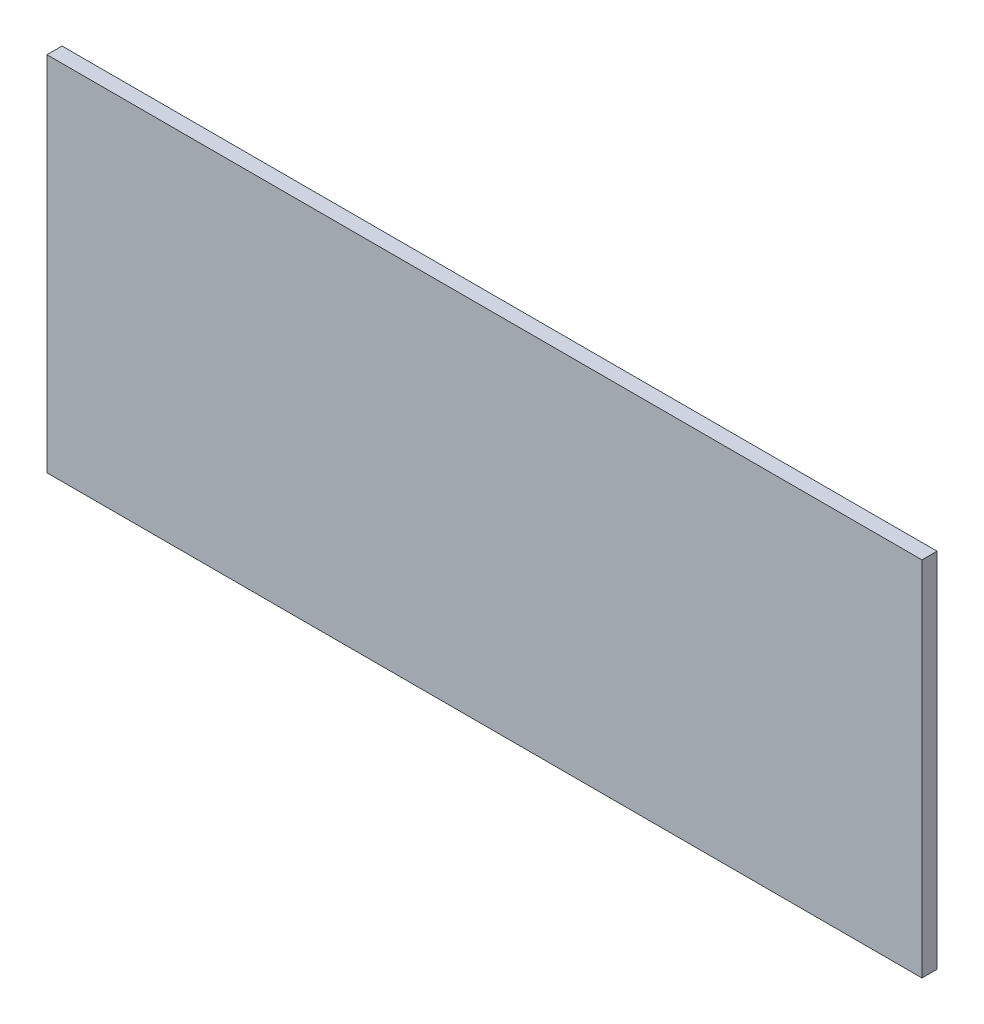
from build123d import *

# Parameters (mm, degrees)
SKETCH1_W      = 1104.9
SKETCH1_H      = 457.2
EXTRUDE1_DEPTH = 19.05


with BuildPart() as part:
    # Sketch1 → Extrude1 (new body)
    with BuildSketch(Plane.XY):
        with Locations((552.45, 228.6)):
            Rectangle(SKETCH1_W, SKETCH1_H)
    extrude(amount=EXTRUDE1_DEPTH)


solid = part.part
